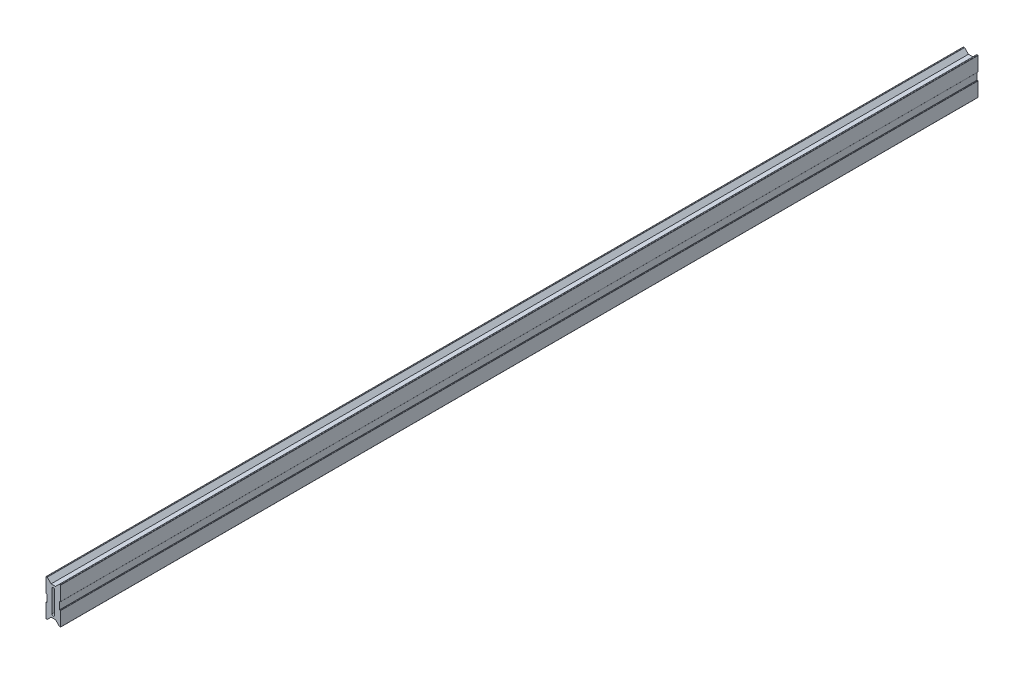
ISO-10303-21;
HEADER;
FILE_DESCRIPTION(('STEP AP214'),'2;1');
FILE_NAME('part.step','',(''),(''),'','','');
FILE_SCHEMA(('AUTOMOTIVE_DESIGN { 1 0 10303 214 1 1 1 1 }'));
ENDSEC;
DATA;
#1=APPLICATION_CONTEXT('core data for automotive mechanical design processes');
#2=APPLICATION_PROTOCOL_DEFINITION('international standard','automotive_design',2000,#1);
#3=PRODUCT_CONTEXT('',#1,'mechanical');
#4=PRODUCT('Part','Part','',(#3));
#5=PRODUCT_RELATED_PRODUCT_CATEGORY('part','',(#4));
#6=PRODUCT_DEFINITION_FORMATION('','',#4);
#7=PRODUCT_DEFINITION_CONTEXT('part definition',#1,'design');
#8=PRODUCT_DEFINITION('design','',#6,#7);
#9=PRODUCT_DEFINITION_SHAPE('','',#8);
#10=(LENGTH_UNIT() NAMED_UNIT(*) SI_UNIT(.MILLI.,.METRE.));
#11=(NAMED_UNIT(*) PLANE_ANGLE_UNIT() SI_UNIT($,.RADIAN.));
#12=(NAMED_UNIT(*) SI_UNIT($,.STERADIAN.) SOLID_ANGLE_UNIT());
#13=UNCERTAINTY_MEASURE_WITH_UNIT(LENGTH_MEASURE(1.E-05),#10,'distance_accuracy_value','');
#14=(GEOMETRIC_REPRESENTATION_CONTEXT(3) GLOBAL_UNCERTAINTY_ASSIGNED_CONTEXT((#13)) GLOBAL_UNIT_ASSIGNED_CONTEXT((#10,
#11,#12)) REPRESENTATION_CONTEXT('',''));
#15=CARTESIAN_POINT('',(0.,0.,0.));
#16=DIRECTION('',(0.,0.,1.));
#17=DIRECTION('',(1.,0.,0.));
#18=AXIS2_PLACEMENT_3D('',#15,#16,#17);
#19=CARTESIAN_POINT('',(-40.9493186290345,10.1531529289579,-238.78253442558));
#20=DIRECTION('',(0.,0.,1.));
#21=DIRECTION('',(1.,0.,0.));
#22=AXIS2_PLACEMENT_3D('',#19,#20,#21);
#23=CYLINDRICAL_SURFACE('',#22,0.127);
#24=CARTESIAN_POINT('',(-40.9493186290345,10.1531529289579,261.21646557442));
#25=DIRECTION('',(0.,0.,1.));
#26=DIRECTION('',(-1.,0.,0.));
#27=AXIS2_PLACEMENT_3D('',#24,#25,#26);
#28=CIRCLE('',#27,0.127);
#29=CARTESIAN_POINT('',(-40.9493186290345,10.2801529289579,261.21646557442));
#30=VERTEX_POINT('',#29);
#31=CARTESIAN_POINT('',(-41.0763186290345,10.1531529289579,261.21646557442));
#32=VERTEX_POINT('',#31);
#33=EDGE_CURVE('E281',#30,#32,#28,.T.);
#34=ORIENTED_EDGE('',*,*,#33,.F.);
#35=DIRECTION('',(0.,0.,1.));
#36=VECTOR('',#35,1.);
#37=CARTESIAN_POINT('',(-40.9493186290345,10.2801529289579,-238.78253442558));
#38=LINE('',#37,#36);
#39=CARTESIAN_POINT('',(-40.9493186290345,10.2801529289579,-238.78253442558));
#40=VERTEX_POINT('',#39);
#41=EDGE_CURVE('E10',#40,#30,#38,.T.);
#42=ORIENTED_EDGE('',*,*,#41,.F.);
#43=CARTESIAN_POINT('',(-40.9493186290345,10.1531529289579,-238.78253442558));
#44=DIRECTION('',(0.,0.,1.));
#45=DIRECTION('',(-1.,0.,0.));
#46=AXIS2_PLACEMENT_3D('',#43,#44,#45);
#47=CIRCLE('',#46,0.127);
#48=CARTESIAN_POINT('',(-41.0763186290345,10.1531529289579,-238.78253442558));
#49=VERTEX_POINT('',#48);
#50=EDGE_CURVE('E285',#40,#49,#47,.T.);
#51=ORIENTED_EDGE('',*,*,#50,.T.);
#52=DIRECTION('',(0.,0.,1.));
#53=VECTOR('',#52,1.);
#54=CARTESIAN_POINT('',(-41.0763186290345,10.1531529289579,-238.78253442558));
#55=LINE('',#54,#53);
#56=EDGE_CURVE('E18',#49,#32,#55,.T.);
#57=ORIENTED_EDGE('',*,*,#56,.T.);
#58=EDGE_LOOP('',(#34,#42,#51,#57));
#59=FACE_BOUND('',#58,.T.);
#60=ADVANCED_FACE('F15',(#59),#23,.T.);
#61=CARTESIAN_POINT('',(-40.5683186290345,10.2801529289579,-238.78253442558));
#62=DIRECTION('',(0.,1.,0.));
#63=DIRECTION('',(0.,0.,1.));
#64=AXIS2_PLACEMENT_3D('',#61,#62,#63);
#65=PLANE('',#64);
#66=DIRECTION('',(-1.,0.,0.));
#67=VECTOR('',#66,1.);
#68=CARTESIAN_POINT('',(-40.5683186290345,10.2801529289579,261.21646557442));
#69=LINE('',#68,#67);
#70=CARTESIAN_POINT('',(-40.5683186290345,10.2801529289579,261.21646557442));
#71=VERTEX_POINT('',#70);
#72=EDGE_CURVE('E289',#71,#30,#69,.T.);
#73=ORIENTED_EDGE('',*,*,#72,.F.);
#74=DIRECTION('',(0.,0.,1.));
#75=VECTOR('',#74,1.);
#76=CARTESIAN_POINT('',(-40.5683186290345,10.2801529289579,-238.78253442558));
#77=LINE('',#76,#75);
#78=CARTESIAN_POINT('',(-40.5683186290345,10.2801529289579,-238.78253442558));
#79=VERTEX_POINT('',#78);
#80=EDGE_CURVE('E23',#79,#71,#77,.T.);
#81=ORIENTED_EDGE('',*,*,#80,.F.);
#82=DIRECTION('',(-1.,0.,0.));
#83=VECTOR('',#82,1.);
#84=CARTESIAN_POINT('',(-40.5683186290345,10.2801529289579,-238.78253442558));
#85=LINE('',#84,#83);
#86=EDGE_CURVE('E379',#79,#40,#85,.T.);
#87=ORIENTED_EDGE('',*,*,#86,.T.);
#88=ORIENTED_EDGE('',*,*,#41,.T.);
#89=EDGE_LOOP('',(#73,#81,#87,#88));
#90=FACE_BOUND('',#89,.T.);
#91=ADVANCED_FACE('F546',(#90),#65,.T.);
#92=CARTESIAN_POINT('',(-40.5683186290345,10.2801529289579,-238.78253442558));
#93=DIRECTION('',(-1.,0.,0.));
#94=DIRECTION('',(0.,0.,1.));
#95=AXIS2_PLACEMENT_3D('',#92,#93,#94);
#96=PLANE('',#95);
#97=DIRECTION('',(0.,-1.,0.));
#98=VECTOR('',#97,1.);
#99=CARTESIAN_POINT('',(-40.5683186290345,10.2801529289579,261.21646557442));
#100=LINE('',#99,#98);
#101=CARTESIAN_POINT('',(-40.5683186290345,14.2933529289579,261.21646557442));
#102=VERTEX_POINT('',#101);
#103=EDGE_CURVE('E471',#102,#71,#100,.T.);
#104=ORIENTED_EDGE('',*,*,#103,.F.);
#105=DIRECTION('',(0.,0.,1.));
#106=VECTOR('',#105,1.);
#107=CARTESIAN_POINT('',(-40.5683186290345,14.2933529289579,-238.78253442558));
#108=LINE('',#107,#106);
#109=CARTESIAN_POINT('',(-40.5683186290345,14.2933529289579,-238.78253442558));
#110=VERTEX_POINT('',#109);
#111=EDGE_CURVE('E477',#110,#102,#108,.T.);
#112=ORIENTED_EDGE('',*,*,#111,.F.);
#113=DIRECTION('',(0.,-1.,0.));
#114=VECTOR('',#113,1.);
#115=CARTESIAN_POINT('',(-40.5683186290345,10.2801529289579,-238.78253442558));
#116=LINE('',#115,#114);
#117=EDGE_CURVE('E376',#110,#79,#116,.T.);
#118=ORIENTED_EDGE('',*,*,#117,.T.);
#119=ORIENTED_EDGE('',*,*,#80,.T.);
#120=EDGE_LOOP('',(#104,#112,#118,#119));
#121=FACE_BOUND('',#120,.T.);
#122=ADVANCED_FACE('F661',(#121),#96,.T.);
#123=CARTESIAN_POINT('',(-40.5683186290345,14.2933529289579,-238.78253442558));
#124=DIRECTION('',(0.,-1.,0.));
#125=DIRECTION('',(0.,0.,-1.));
#126=AXIS2_PLACEMENT_3D('',#123,#124,#125);
#127=PLANE('',#126);
#128=DIRECTION('',(1.,0.,0.));
#129=VECTOR('',#128,1.);
#130=CARTESIAN_POINT('',(-40.5683186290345,14.2933529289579,261.21646557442));
#131=LINE('',#130,#129);
#132=CARTESIAN_POINT('',(-40.9493186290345,14.2933529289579,261.21646557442));
#133=VERTEX_POINT('',#132);
#134=EDGE_CURVE('E468',#133,#102,#131,.T.);
#135=ORIENTED_EDGE('',*,*,#134,.F.);
#136=DIRECTION('',(0.,0.,1.));
#137=VECTOR('',#136,1.);
#138=CARTESIAN_POINT('',(-40.9493186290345,14.2933529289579,-238.78253442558));
#139=LINE('',#138,#137);
#140=CARTESIAN_POINT('',(-40.9493186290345,14.2933529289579,-238.78253442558));
#141=VERTEX_POINT('',#140);
#142=EDGE_CURVE('E479',#141,#133,#139,.T.);
#143=ORIENTED_EDGE('',*,*,#142,.F.);
#144=DIRECTION('',(1.,0.,0.));
#145=VECTOR('',#144,1.);
#146=CARTESIAN_POINT('',(-40.5683186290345,14.2933529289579,-238.78253442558));
#147=LINE('',#146,#145);
#148=EDGE_CURVE('E373',#141,#110,#147,.T.);
#149=ORIENTED_EDGE('',*,*,#148,.T.);
#150=ORIENTED_EDGE('',*,*,#111,.T.);
#151=EDGE_LOOP('',(#135,#143,#149,#150));
#152=FACE_BOUND('',#151,.T.);
#153=ADVANCED_FACE('F659',(#152),#127,.T.);
#154=CARTESIAN_POINT('',(-40.9493186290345,14.4203529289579,-238.78253442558));
#155=DIRECTION('',(0.,0.,1.));
#156=DIRECTION('',(1.,0.,0.));
#157=AXIS2_PLACEMENT_3D('',#154,#155,#156);
#158=CYLINDRICAL_SURFACE('',#157,0.127);
#159=CARTESIAN_POINT('',(-40.9493186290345,14.4203529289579,261.21646557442));
#160=DIRECTION('',(0.,0.,1.));
#161=DIRECTION('',(1.,0.,0.));
#162=AXIS2_PLACEMENT_3D('',#159,#160,#161);
#163=CIRCLE('',#162,0.127);
#164=CARTESIAN_POINT('',(-41.0763186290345,14.4203529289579,261.21646557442));
#165=VERTEX_POINT('',#164);
#166=EDGE_CURVE('E465',#165,#133,#163,.T.);
#167=ORIENTED_EDGE('',*,*,#166,.F.);
#168=DIRECTION('',(0.,0.,1.));
#169=VECTOR('',#168,1.);
#170=CARTESIAN_POINT('',(-41.0763186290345,14.4203529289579,-238.78253442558));
#171=LINE('',#170,#169);
#172=CARTESIAN_POINT('',(-41.0763186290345,14.4203529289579,-238.78253442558));
#173=VERTEX_POINT('',#172);
#174=EDGE_CURVE('E481',#173,#165,#171,.T.);
#175=ORIENTED_EDGE('',*,*,#174,.F.);
#176=CARTESIAN_POINT('',(-40.9493186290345,14.4203529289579,-238.78253442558));
#177=DIRECTION('',(0.,0.,1.));
#178=DIRECTION('',(1.,0.,0.));
#179=AXIS2_PLACEMENT_3D('',#176,#177,#178);
#180=CIRCLE('',#179,0.127);
#181=EDGE_CURVE('E370',#173,#141,#180,.T.);
#182=ORIENTED_EDGE('',*,*,#181,.T.);
#183=ORIENTED_EDGE('',*,*,#142,.T.);
#184=EDGE_LOOP('',(#167,#175,#182,#183));
#185=FACE_BOUND('',#184,.T.);
#186=ADVANCED_FACE('F655',(#185),#158,.T.);
#187=CARTESIAN_POINT('',(-41.0763186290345,22.1546529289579,-238.78253442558));
#188=DIRECTION('',(-1.,0.,0.));
#189=DIRECTION('',(0.,0.,1.));
#190=AXIS2_PLACEMENT_3D('',#187,#188,#189);
#191=PLANE('',#190);
#192=DIRECTION('',(0.,-1.,0.));
#193=VECTOR('',#192,1.);
#194=CARTESIAN_POINT('',(-41.0763186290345,22.1546529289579,261.21646557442));
#195=LINE('',#194,#193);
#196=CARTESIAN_POINT('',(-41.0763186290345,22.1546529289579,261.21646557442));
#197=VERTEX_POINT('',#196);
#198=EDGE_CURVE('E462',#197,#165,#195,.T.);
#199=ORIENTED_EDGE('',*,*,#198,.F.);
#200=DIRECTION('',(0.,0.,1.));
#201=VECTOR('',#200,1.);
#202=CARTESIAN_POINT('',(-41.0763186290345,22.1546529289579,-238.78253442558));
#203=LINE('',#202,#201);
#204=CARTESIAN_POINT('',(-41.0763186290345,22.1546529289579,-238.78253442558));
#205=VERTEX_POINT('',#204);
#206=EDGE_CURVE('E483',#205,#197,#203,.T.);
#207=ORIENTED_EDGE('',*,*,#206,.F.);
#208=DIRECTION('',(0.,-1.,0.));
#209=VECTOR('',#208,1.);
#210=CARTESIAN_POINT('',(-41.0763186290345,22.1546529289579,-238.78253442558));
#211=LINE('',#210,#209);
#212=EDGE_CURVE('E367',#205,#173,#211,.T.);
#213=ORIENTED_EDGE('',*,*,#212,.T.);
#214=ORIENTED_EDGE('',*,*,#174,.T.);
#215=EDGE_LOOP('',(#199,#207,#213,#214));
#216=FACE_BOUND('',#215,.T.);
#217=ADVANCED_FACE('F651',(#216),#191,.T.);
#218=CARTESIAN_POINT('',(-40.9493186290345,22.1546529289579,-238.78253442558));
#219=DIRECTION('',(0.,0.,1.));
#220=DIRECTION('',(1.,0.,0.));
#221=AXIS2_PLACEMENT_3D('',#218,#219,#220);
#222=CYLINDRICAL_SURFACE('',#221,0.127000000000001);
#223=CARTESIAN_POINT('',(-40.9493186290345,22.1546529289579,261.21646557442));
#224=DIRECTION('',(0.,0.,1.));
#225=DIRECTION('',(1.,0.,0.));
#226=AXIS2_PLACEMENT_3D('',#223,#224,#225);
#227=CIRCLE('',#226,0.127000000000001);
#228=CARTESIAN_POINT('',(-40.9493186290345,22.2816529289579,261.21646557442));
#229=VERTEX_POINT('',#228);
#230=EDGE_CURVE('E459',#229,#197,#227,.T.);
#231=ORIENTED_EDGE('',*,*,#230,.F.);
#232=DIRECTION('',(0.,0.,1.));
#233=VECTOR('',#232,1.);
#234=CARTESIAN_POINT('',(-40.9493186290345,22.2816529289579,-238.78253442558));
#235=LINE('',#234,#233);
#236=CARTESIAN_POINT('',(-40.9493186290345,22.2816529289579,-238.78253442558));
#237=VERTEX_POINT('',#236);
#238=EDGE_CURVE('E485',#237,#229,#235,.T.);
#239=ORIENTED_EDGE('',*,*,#238,.F.);
#240=CARTESIAN_POINT('',(-40.9493186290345,22.1546529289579,-238.78253442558));
#241=DIRECTION('',(0.,0.,1.));
#242=DIRECTION('',(1.,0.,0.));
#243=AXIS2_PLACEMENT_3D('',#240,#241,#242);
#244=CIRCLE('',#243,0.127000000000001);
#245=EDGE_CURVE('E364',#237,#205,#244,.T.);
#246=ORIENTED_EDGE('',*,*,#245,.T.);
#247=ORIENTED_EDGE('',*,*,#206,.T.);
#248=EDGE_LOOP('',(#231,#239,#246,#247));
#249=FACE_BOUND('',#248,.T.);
#250=ADVANCED_FACE('F647',(#249),#222,.T.);
#251=CARTESIAN_POINT('',(-40.9493186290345,22.2816529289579,-238.78253442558));
#252=DIRECTION('',(0.,1.,0.));
#253=DIRECTION('',(0.,0.,1.));
#254=AXIS2_PLACEMENT_3D('',#251,#252,#253);
#255=PLANE('',#254);
#256=DIRECTION('',(-1.,0.,0.));
#257=VECTOR('',#256,1.);
#258=CARTESIAN_POINT('',(-40.9493186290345,22.2816529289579,261.21646557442));
#259=LINE('',#258,#257);
#260=CARTESIAN_POINT('',(-40.4685237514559,22.2816529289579,261.21646557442));
#261=VERTEX_POINT('',#260);
#262=EDGE_CURVE('E456',#261,#229,#259,.T.);
#263=ORIENTED_EDGE('',*,*,#262,.F.);
#264=DIRECTION('',(0.,0.,1.));
#265=VECTOR('',#264,1.);
#266=CARTESIAN_POINT('',(-40.4685237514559,22.2816529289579,-238.78253442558));
#267=LINE('',#266,#265);
#268=CARTESIAN_POINT('',(-40.4685237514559,22.2816529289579,-238.78253442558));
#269=VERTEX_POINT('',#268);
#270=EDGE_CURVE('E487',#269,#261,#267,.T.);
#271=ORIENTED_EDGE('',*,*,#270,.F.);
#272=DIRECTION('',(-1.,0.,0.));
#273=VECTOR('',#272,1.);
#274=CARTESIAN_POINT('',(-40.9493186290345,22.2816529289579,-238.78253442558));
#275=LINE('',#274,#273);
#276=EDGE_CURVE('E361',#269,#237,#275,.T.);
#277=ORIENTED_EDGE('',*,*,#276,.T.);
#278=ORIENTED_EDGE('',*,*,#238,.T.);
#279=EDGE_LOOP('',(#263,#271,#277,#278));
#280=FACE_BOUND('',#279,.T.);
#281=ADVANCED_FACE('F643',(#280),#255,.T.);
#282=CARTESIAN_POINT('',(-40.4685237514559,22.1546529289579,-238.78253442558));
#283=DIRECTION('',(0.,0.,1.));
#284=DIRECTION('',(1.,0.,0.));
#285=AXIS2_PLACEMENT_3D('',#282,#283,#284);
#286=CYLINDRICAL_SURFACE('',#285,0.127000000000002);
#287=CARTESIAN_POINT('',(-40.4685237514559,22.1546529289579,261.21646557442));
#288=DIRECTION('',(0.,0.,1.));
#289=DIRECTION('',(1.,0.,0.));
#290=AXIS2_PLACEMENT_3D('',#287,#288,#289);
#291=CIRCLE('',#290,0.127000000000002);
#292=CARTESIAN_POINT('',(-40.3787211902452,22.2444554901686,261.21646557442));
#293=VERTEX_POINT('',#292);
#294=EDGE_CURVE('E453',#293,#261,#291,.T.);
#295=ORIENTED_EDGE('',*,*,#294,.F.);
#296=DIRECTION('',(0.,0.,1.));
#297=VECTOR('',#296,1.);
#298=CARTESIAN_POINT('',(-40.3787211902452,22.2444554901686,-238.78253442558));
#299=LINE('',#298,#297);
#300=CARTESIAN_POINT('',(-40.3787211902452,22.2444554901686,-238.78253442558));
#301=VERTEX_POINT('',#300);
#302=EDGE_CURVE('E489',#301,#293,#299,.T.);
#303=ORIENTED_EDGE('',*,*,#302,.F.);
#304=CARTESIAN_POINT('',(-40.4685237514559,22.1546529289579,-238.78253442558));
#305=DIRECTION('',(0.,0.,1.));
#306=DIRECTION('',(1.,0.,0.));
#307=AXIS2_PLACEMENT_3D('',#304,#305,#306);
#308=CIRCLE('',#307,0.127000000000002);
#309=EDGE_CURVE('E358',#301,#269,#308,.T.);
#310=ORIENTED_EDGE('',*,*,#309,.T.);
#311=ORIENTED_EDGE('',*,*,#270,.T.);
#312=EDGE_LOOP('',(#295,#303,#310,#311));
#313=FACE_BOUND('',#312,.T.);
#314=ADVANCED_FACE('F639',(#313),#286,.T.);
#315=CARTESIAN_POINT('',(-38.2823186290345,20.1480529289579,-238.78253442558));
#316=DIRECTION('',(0.707106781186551,0.707106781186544,0.));
#317=DIRECTION('',(-0.707106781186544,0.707106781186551,0.));
#318=AXIS2_PLACEMENT_3D('',#315,#316,#317);
#319=PLANE('',#318);
#320=DIRECTION('',(-0.707106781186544,0.707106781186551,0.));
#321=VECTOR('',#320,1.);
#322=CARTESIAN_POINT('',(-38.2823186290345,20.1480529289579,261.21646557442));
#323=LINE('',#322,#321);
#324=CARTESIAN_POINT('',(-38.2823186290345,20.1480529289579,261.21646557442));
#325=VERTEX_POINT('',#324);
#326=EDGE_CURVE('E450',#325,#293,#323,.T.);
#327=ORIENTED_EDGE('',*,*,#326,.F.);
#328=DIRECTION('',(0.,0.,1.));
#329=VECTOR('',#328,1.);
#330=CARTESIAN_POINT('',(-38.2823186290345,20.1480529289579,-238.78253442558));
#331=LINE('',#330,#329);
#332=CARTESIAN_POINT('',(-38.2823186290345,20.1480529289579,-238.78253442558));
#333=VERTEX_POINT('',#332);
#334=EDGE_CURVE('E491',#333,#325,#331,.T.);
#335=ORIENTED_EDGE('',*,*,#334,.F.);
#336=DIRECTION('',(-0.707106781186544,0.707106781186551,0.));
#337=VECTOR('',#336,1.);
#338=CARTESIAN_POINT('',(-38.2823186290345,20.1480529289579,-238.78253442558));
#339=LINE('',#338,#337);
#340=EDGE_CURVE('E355',#333,#301,#339,.T.);
#341=ORIENTED_EDGE('',*,*,#340,.T.);
#342=ORIENTED_EDGE('',*,*,#302,.T.);
#343=EDGE_LOOP('',(#327,#335,#341,#342));
#344=FACE_BOUND('',#343,.T.);
#345=ADVANCED_FACE('F635',(#344),#319,.T.);
#346=CARTESIAN_POINT('',(-38.2823186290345,20.1480529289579,-238.78253442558));
#347=DIRECTION('',(0.,1.,0.));
#348=DIRECTION('',(0.,0.,1.));
#349=AXIS2_PLACEMENT_3D('',#346,#347,#348);
#350=PLANE('',#349);
#351=DIRECTION('',(-1.,0.,0.));
#352=VECTOR('',#351,1.);
#353=CARTESIAN_POINT('',(-38.2823186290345,20.1480529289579,261.21646557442));
#354=LINE('',#353,#352);
#355=CARTESIAN_POINT('',(-35.8693186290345,20.1480529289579,261.21646557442));
#356=VERTEX_POINT('',#355);
#357=EDGE_CURVE('E447',#356,#325,#354,.T.);
#358=ORIENTED_EDGE('',*,*,#357,.F.);
#359=DIRECTION('',(0.,0.,1.));
#360=VECTOR('',#359,1.);
#361=CARTESIAN_POINT('',(-35.8693186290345,20.1480529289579,-238.78253442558));
#362=LINE('',#361,#360);
#363=CARTESIAN_POINT('',(-35.8693186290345,20.1480529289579,-238.78253442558));
#364=VERTEX_POINT('',#363);
#365=EDGE_CURVE('E493',#364,#356,#362,.T.);
#366=ORIENTED_EDGE('',*,*,#365,.F.);
#367=DIRECTION('',(-1.,0.,0.));
#368=VECTOR('',#367,1.);
#369=CARTESIAN_POINT('',(-38.2823186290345,20.1480529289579,-238.78253442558));
#370=LINE('',#369,#368);
#371=EDGE_CURVE('E352',#364,#333,#370,.T.);
#372=ORIENTED_EDGE('',*,*,#371,.T.);
#373=ORIENTED_EDGE('',*,*,#334,.T.);
#374=EDGE_LOOP('',(#358,#366,#372,#373));
#375=FACE_BOUND('',#374,.T.);
#376=ADVANCED_FACE('F631',(#375),#350,.T.);
#377=CARTESIAN_POINT('',(-35.8693186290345,20.1480529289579,-238.78253442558));
#378=DIRECTION('',(-0.707106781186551,0.707106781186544,0.));
#379=DIRECTION('',(-0.707106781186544,-0.707106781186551,0.));
#380=AXIS2_PLACEMENT_3D('',#377,#378,#379);
#381=PLANE('',#380);
#382=DIRECTION('',(-0.707106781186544,-0.707106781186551,0.));
#383=VECTOR('',#382,1.);
#384=CARTESIAN_POINT('',(-35.8693186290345,20.1480529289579,261.21646557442));
#385=LINE('',#384,#383);
#386=CARTESIAN_POINT('',(-33.7729160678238,22.2444554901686,261.21646557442));
#387=VERTEX_POINT('',#386);
#388=EDGE_CURVE('E444',#387,#356,#385,.T.);
#389=ORIENTED_EDGE('',*,*,#388,.F.);
#390=DIRECTION('',(0.,0.,1.));
#391=VECTOR('',#390,1.);
#392=CARTESIAN_POINT('',(-33.7729160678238,22.2444554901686,-238.78253442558));
#393=LINE('',#392,#391);
#394=CARTESIAN_POINT('',(-33.7729160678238,22.2444554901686,-238.78253442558));
#395=VERTEX_POINT('',#394);
#396=EDGE_CURVE('E495',#395,#387,#393,.T.);
#397=ORIENTED_EDGE('',*,*,#396,.F.);
#398=DIRECTION('',(-0.707106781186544,-0.707106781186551,0.));
#399=VECTOR('',#398,1.);
#400=CARTESIAN_POINT('',(-35.8693186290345,20.1480529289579,-238.78253442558));
#401=LINE('',#400,#399);
#402=EDGE_CURVE('E349',#395,#364,#401,.T.);
#403=ORIENTED_EDGE('',*,*,#402,.T.);
#404=ORIENTED_EDGE('',*,*,#365,.T.);
#405=EDGE_LOOP('',(#389,#397,#403,#404));
#406=FACE_BOUND('',#405,.T.);
#407=ADVANCED_FACE('F627',(#406),#381,.T.);
#408=CARTESIAN_POINT('',(-33.6831135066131,22.1546529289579,-238.78253442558));
#409=DIRECTION('',(0.,0.,1.));
#410=DIRECTION('',(1.,0.,0.));
#411=AXIS2_PLACEMENT_3D('',#408,#409,#410);
#412=CYLINDRICAL_SURFACE('',#411,0.127000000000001);
#413=CARTESIAN_POINT('',(-33.6831135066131,22.1546529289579,261.21646557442));
#414=DIRECTION('',(0.,0.,1.));
#415=DIRECTION('',(-1.,0.,0.));
#416=AXIS2_PLACEMENT_3D('',#413,#414,#415);
#417=CIRCLE('',#416,0.127000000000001);
#418=CARTESIAN_POINT('',(-33.6831135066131,22.2816529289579,261.21646557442));
#419=VERTEX_POINT('',#418);
#420=EDGE_CURVE('E441',#419,#387,#417,.T.);
#421=ORIENTED_EDGE('',*,*,#420,.F.);
#422=DIRECTION('',(0.,0.,1.));
#423=VECTOR('',#422,1.);
#424=CARTESIAN_POINT('',(-33.6831135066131,22.2816529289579,-238.78253442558));
#425=LINE('',#424,#423);
#426=CARTESIAN_POINT('',(-33.6831135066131,22.2816529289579,-238.78253442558));
#427=VERTEX_POINT('',#426);
#428=EDGE_CURVE('E497',#427,#419,#425,.T.);
#429=ORIENTED_EDGE('',*,*,#428,.F.);
#430=CARTESIAN_POINT('',(-33.6831135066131,22.1546529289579,-238.78253442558));
#431=DIRECTION('',(0.,0.,1.));
#432=DIRECTION('',(-1.,0.,0.));
#433=AXIS2_PLACEMENT_3D('',#430,#431,#432);
#434=CIRCLE('',#433,0.127000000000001);
#435=EDGE_CURVE('E346',#427,#395,#434,.T.);
#436=ORIENTED_EDGE('',*,*,#435,.T.);
#437=ORIENTED_EDGE('',*,*,#396,.T.);
#438=EDGE_LOOP('',(#421,#429,#436,#437));
#439=FACE_BOUND('',#438,.T.);
#440=ADVANCED_FACE('F623',(#439),#412,.T.);
#441=CARTESIAN_POINT('',(-33.2023186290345,22.2816529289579,-238.78253442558));
#442=DIRECTION('',(0.,1.,0.));
#443=DIRECTION('',(0.,0.,1.));
#444=AXIS2_PLACEMENT_3D('',#441,#442,#443);
#445=PLANE('',#444);
#446=DIRECTION('',(-1.,0.,0.));
#447=VECTOR('',#446,1.);
#448=CARTESIAN_POINT('',(-33.2023186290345,22.2816529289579,261.21646557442));
#449=LINE('',#448,#447);
#450=CARTESIAN_POINT('',(-33.2023186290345,22.2816529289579,261.21646557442));
#451=VERTEX_POINT('',#450);
#452=EDGE_CURVE('E438',#451,#419,#449,.T.);
#453=ORIENTED_EDGE('',*,*,#452,.F.);
#454=DIRECTION('',(0.,0.,1.));
#455=VECTOR('',#454,1.);
#456=CARTESIAN_POINT('',(-33.2023186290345,22.2816529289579,-238.78253442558));
#457=LINE('',#456,#455);
#458=CARTESIAN_POINT('',(-33.2023186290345,22.2816529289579,-238.78253442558));
#459=VERTEX_POINT('',#458);
#460=EDGE_CURVE('E499',#459,#451,#457,.T.);
#461=ORIENTED_EDGE('',*,*,#460,.F.);
#462=DIRECTION('',(-1.,0.,0.));
#463=VECTOR('',#462,1.);
#464=CARTESIAN_POINT('',(-33.2023186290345,22.2816529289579,-238.78253442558));
#465=LINE('',#464,#463);
#466=EDGE_CURVE('E343',#459,#427,#465,.T.);
#467=ORIENTED_EDGE('',*,*,#466,.T.);
#468=ORIENTED_EDGE('',*,*,#428,.T.);
#469=EDGE_LOOP('',(#453,#461,#467,#468));
#470=FACE_BOUND('',#469,.T.);
#471=ADVANCED_FACE('F619',(#470),#445,.T.);
#472=CARTESIAN_POINT('',(-33.2023186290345,22.1546529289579,-238.78253442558));
#473=DIRECTION('',(0.,0.,1.));
#474=DIRECTION('',(1.,0.,0.));
#475=AXIS2_PLACEMENT_3D('',#472,#473,#474);
#476=CYLINDRICAL_SURFACE('',#475,0.127000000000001);
#477=CARTESIAN_POINT('',(-33.2023186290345,22.1546529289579,261.21646557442));
#478=DIRECTION('',(0.,0.,1.));
#479=DIRECTION('',(-1.,0.,0.));
#480=AXIS2_PLACEMENT_3D('',#477,#478,#479);
#481=CIRCLE('',#480,0.127000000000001);
#482=CARTESIAN_POINT('',(-33.0753186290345,22.1546529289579,261.21646557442));
#483=VERTEX_POINT('',#482);
#484=EDGE_CURVE('E435',#483,#451,#481,.T.);
#485=ORIENTED_EDGE('',*,*,#484,.F.);
#486=DIRECTION('',(0.,0.,1.));
#487=VECTOR('',#486,1.);
#488=CARTESIAN_POINT('',(-33.0753186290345,22.1546529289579,-238.78253442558));
#489=LINE('',#488,#487);
#490=CARTESIAN_POINT('',(-33.0753186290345,22.1546529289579,-238.78253442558));
#491=VERTEX_POINT('',#490);
#492=EDGE_CURVE('E501',#491,#483,#489,.T.);
#493=ORIENTED_EDGE('',*,*,#492,.F.);
#494=CARTESIAN_POINT('',(-33.2023186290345,22.1546529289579,-238.78253442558));
#495=DIRECTION('',(0.,0.,1.));
#496=DIRECTION('',(-1.,0.,0.));
#497=AXIS2_PLACEMENT_3D('',#494,#495,#496);
#498=CIRCLE('',#497,0.127000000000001);
#499=EDGE_CURVE('E340',#491,#459,#498,.T.);
#500=ORIENTED_EDGE('',*,*,#499,.T.);
#501=ORIENTED_EDGE('',*,*,#460,.T.);
#502=EDGE_LOOP('',(#485,#493,#500,#501));
#503=FACE_BOUND('',#502,.T.);
#504=ADVANCED_FACE('F615',(#503),#476,.T.);
#505=CARTESIAN_POINT('',(-33.0753186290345,22.1546529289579,-238.78253442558));
#506=DIRECTION('',(1.,0.,0.));
#507=DIRECTION('',(0.,0.,-1.));
#508=AXIS2_PLACEMENT_3D('',#505,#506,#507);
#509=PLANE('',#508);
#510=DIRECTION('',(0.,1.,0.));
#511=VECTOR('',#510,1.);
#512=CARTESIAN_POINT('',(-33.0753186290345,22.1546529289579,261.21646557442));
#513=LINE('',#512,#511);
#514=CARTESIAN_POINT('',(-33.0753186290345,14.4203529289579,261.21646557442));
#515=VERTEX_POINT('',#514);
#516=EDGE_CURVE('E432',#515,#483,#513,.T.);
#517=ORIENTED_EDGE('',*,*,#516,.F.);
#518=DIRECTION('',(0.,0.,1.));
#519=VECTOR('',#518,1.);
#520=CARTESIAN_POINT('',(-33.0753186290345,14.4203529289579,-238.78253442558));
#521=LINE('',#520,#519);
#522=CARTESIAN_POINT('',(-33.0753186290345,14.4203529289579,-238.78253442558));
#523=VERTEX_POINT('',#522);
#524=EDGE_CURVE('E503',#523,#515,#521,.T.);
#525=ORIENTED_EDGE('',*,*,#524,.F.);
#526=DIRECTION('',(0.,1.,0.));
#527=VECTOR('',#526,1.);
#528=CARTESIAN_POINT('',(-33.0753186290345,22.1546529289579,-238.78253442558));
#529=LINE('',#528,#527);
#530=EDGE_CURVE('E337',#523,#491,#529,.T.);
#531=ORIENTED_EDGE('',*,*,#530,.T.);
#532=ORIENTED_EDGE('',*,*,#492,.T.);
#533=EDGE_LOOP('',(#517,#525,#531,#532));
#534=FACE_BOUND('',#533,.T.);
#535=ADVANCED_FACE('F611',(#534),#509,.T.);
#536=CARTESIAN_POINT('',(-33.2023186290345,14.4203529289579,-238.78253442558));
#537=DIRECTION('',(0.,0.,1.));
#538=DIRECTION('',(1.,0.,0.));
#539=AXIS2_PLACEMENT_3D('',#536,#537,#538);
#540=CYLINDRICAL_SURFACE('',#539,0.127);
#541=CARTESIAN_POINT('',(-33.2023186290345,14.4203529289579,261.21646557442));
#542=DIRECTION('',(0.,0.,1.));
#543=DIRECTION('',(-1.,0.,0.));
#544=AXIS2_PLACEMENT_3D('',#541,#542,#543);
#545=CIRCLE('',#544,0.127);
#546=CARTESIAN_POINT('',(-33.2023186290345,14.2933529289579,261.21646557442));
#547=VERTEX_POINT('',#546);
#548=EDGE_CURVE('E429',#547,#515,#545,.T.);
#549=ORIENTED_EDGE('',*,*,#548,.F.);
#550=DIRECTION('',(0.,0.,1.));
#551=VECTOR('',#550,1.);
#552=CARTESIAN_POINT('',(-33.2023186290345,14.2933529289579,-238.78253442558));
#553=LINE('',#552,#551);
#554=CARTESIAN_POINT('',(-33.2023186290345,14.2933529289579,-238.78253442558));
#555=VERTEX_POINT('',#554);
#556=EDGE_CURVE('E505',#555,#547,#553,.T.);
#557=ORIENTED_EDGE('',*,*,#556,.F.);
#558=CARTESIAN_POINT('',(-33.2023186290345,14.4203529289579,-238.78253442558));
#559=DIRECTION('',(0.,0.,1.));
#560=DIRECTION('',(-1.,0.,0.));
#561=AXIS2_PLACEMENT_3D('',#558,#559,#560);
#562=CIRCLE('',#561,0.127);
#563=EDGE_CURVE('E334',#555,#523,#562,.T.);
#564=ORIENTED_EDGE('',*,*,#563,.T.);
#565=ORIENTED_EDGE('',*,*,#524,.T.);
#566=EDGE_LOOP('',(#549,#557,#564,#565));
#567=FACE_BOUND('',#566,.T.);
#568=ADVANCED_FACE('F607',(#567),#540,.T.);
#569=CARTESIAN_POINT('',(-33.5833186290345,14.2933529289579,-238.78253442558));
#570=DIRECTION('',(0.,-1.,0.));
#571=DIRECTION('',(0.,0.,-1.));
#572=AXIS2_PLACEMENT_3D('',#569,#570,#571);
#573=PLANE('',#572);
#574=DIRECTION('',(1.,0.,0.));
#575=VECTOR('',#574,1.);
#576=CARTESIAN_POINT('',(-33.5833186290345,14.2933529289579,261.21646557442));
#577=LINE('',#576,#575);
#578=CARTESIAN_POINT('',(-33.5833186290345,14.2933529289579,261.21646557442));
#579=VERTEX_POINT('',#578);
#580=EDGE_CURVE('E426',#579,#547,#577,.T.);
#581=ORIENTED_EDGE('',*,*,#580,.F.);
#582=DIRECTION('',(0.,0.,1.));
#583=VECTOR('',#582,1.);
#584=CARTESIAN_POINT('',(-33.5833186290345,14.2933529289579,-238.78253442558));
#585=LINE('',#584,#583);
#586=CARTESIAN_POINT('',(-33.5833186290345,14.2933529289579,-238.78253442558));
#587=VERTEX_POINT('',#586);
#588=EDGE_CURVE('E507',#587,#579,#585,.T.);
#589=ORIENTED_EDGE('',*,*,#588,.F.);
#590=DIRECTION('',(1.,0.,0.));
#591=VECTOR('',#590,1.);
#592=CARTESIAN_POINT('',(-33.5833186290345,14.2933529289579,-238.78253442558));
#593=LINE('',#592,#591);
#594=EDGE_CURVE('E331',#587,#555,#593,.T.);
#595=ORIENTED_EDGE('',*,*,#594,.T.);
#596=ORIENTED_EDGE('',*,*,#556,.T.);
#597=EDGE_LOOP('',(#581,#589,#595,#596));
#598=FACE_BOUND('',#597,.T.);
#599=ADVANCED_FACE('F603',(#598),#573,.T.);
#600=CARTESIAN_POINT('',(-33.5833186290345,10.2801529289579,-238.78253442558));
#601=DIRECTION('',(1.,0.,0.));
#602=DIRECTION('',(0.,0.,-1.));
#603=AXIS2_PLACEMENT_3D('',#600,#601,#602);
#604=PLANE('',#603);
#605=DIRECTION('',(0.,1.,0.));
#606=VECTOR('',#605,1.);
#607=CARTESIAN_POINT('',(-33.5833186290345,10.2801529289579,261.21646557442));
#608=LINE('',#607,#606);
#609=CARTESIAN_POINT('',(-33.5833186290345,10.2801529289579,261.21646557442));
#610=VERTEX_POINT('',#609);
#611=EDGE_CURVE('E423',#610,#579,#608,.T.);
#612=ORIENTED_EDGE('',*,*,#611,.F.);
#613=DIRECTION('',(0.,0.,1.));
#614=VECTOR('',#613,1.);
#615=CARTESIAN_POINT('',(-33.5833186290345,10.2801529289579,-238.78253442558));
#616=LINE('',#615,#614);
#617=CARTESIAN_POINT('',(-33.5833186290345,10.2801529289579,-238.78253442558));
#618=VERTEX_POINT('',#617);
#619=EDGE_CURVE('E509',#618,#610,#616,.T.);
#620=ORIENTED_EDGE('',*,*,#619,.F.);
#621=DIRECTION('',(0.,1.,0.));
#622=VECTOR('',#621,1.);
#623=CARTESIAN_POINT('',(-33.5833186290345,10.2801529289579,-238.78253442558));
#624=LINE('',#623,#622);
#625=EDGE_CURVE('E328',#618,#587,#624,.T.);
#626=ORIENTED_EDGE('',*,*,#625,.T.);
#627=ORIENTED_EDGE('',*,*,#588,.T.);
#628=EDGE_LOOP('',(#612,#620,#626,#627));
#629=FACE_BOUND('',#628,.T.);
#630=ADVANCED_FACE('F599',(#629),#604,.T.);
#631=CARTESIAN_POINT('',(-33.5833186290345,10.2801529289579,-238.78253442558));
#632=DIRECTION('',(0.,1.,0.));
#633=DIRECTION('',(0.,0.,1.));
#634=AXIS2_PLACEMENT_3D('',#631,#632,#633);
#635=PLANE('',#634);
#636=DIRECTION('',(-1.,0.,0.));
#637=VECTOR('',#636,1.);
#638=CARTESIAN_POINT('',(-33.5833186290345,10.2801529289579,261.21646557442));
#639=LINE('',#638,#637);
#640=CARTESIAN_POINT('',(-33.2023186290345,10.2801529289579,261.21646557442));
#641=VERTEX_POINT('',#640);
#642=EDGE_CURVE('E420',#641,#610,#639,.T.);
#643=ORIENTED_EDGE('',*,*,#642,.F.);
#644=DIRECTION('',(0.,0.,1.));
#645=VECTOR('',#644,1.);
#646=CARTESIAN_POINT('',(-33.2023186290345,10.2801529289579,-238.78253442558));
#647=LINE('',#646,#645);
#648=CARTESIAN_POINT('',(-33.2023186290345,10.2801529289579,-238.78253442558));
#649=VERTEX_POINT('',#648);
#650=EDGE_CURVE('E511',#649,#641,#647,.T.);
#651=ORIENTED_EDGE('',*,*,#650,.F.);
#652=DIRECTION('',(-1.,0.,0.));
#653=VECTOR('',#652,1.);
#654=CARTESIAN_POINT('',(-33.5833186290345,10.2801529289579,-238.78253442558));
#655=LINE('',#654,#653);
#656=EDGE_CURVE('E325',#649,#618,#655,.T.);
#657=ORIENTED_EDGE('',*,*,#656,.T.);
#658=ORIENTED_EDGE('',*,*,#619,.T.);
#659=EDGE_LOOP('',(#643,#651,#657,#658));
#660=FACE_BOUND('',#659,.T.);
#661=ADVANCED_FACE('F595',(#660),#635,.T.);
#662=CARTESIAN_POINT('',(-33.2023186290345,10.1531529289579,-238.78253442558));
#663=DIRECTION('',(0.,0.,1.));
#664=DIRECTION('',(1.,0.,0.));
#665=AXIS2_PLACEMENT_3D('',#662,#663,#664);
#666=CYLINDRICAL_SURFACE('',#665,0.127);
#667=CARTESIAN_POINT('',(-33.2023186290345,10.1531529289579,261.21646557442));
#668=DIRECTION('',(0.,0.,1.));
#669=DIRECTION('',(1.,0.,0.));
#670=AXIS2_PLACEMENT_3D('',#667,#668,#669);
#671=CIRCLE('',#670,0.127);
#672=CARTESIAN_POINT('',(-33.0753186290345,10.1531529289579,261.21646557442));
#673=VERTEX_POINT('',#672);
#674=EDGE_CURVE('E417',#673,#641,#671,.T.);
#675=ORIENTED_EDGE('',*,*,#674,.F.);
#676=DIRECTION('',(0.,0.,1.));
#677=VECTOR('',#676,1.);
#678=CARTESIAN_POINT('',(-33.0753186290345,10.1531529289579,-238.78253442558));
#679=LINE('',#678,#677);
#680=CARTESIAN_POINT('',(-33.0753186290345,10.1531529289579,-238.78253442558));
#681=VERTEX_POINT('',#680);
#682=EDGE_CURVE('E513',#681,#673,#679,.T.);
#683=ORIENTED_EDGE('',*,*,#682,.F.);
#684=CARTESIAN_POINT('',(-33.2023186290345,10.1531529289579,-238.78253442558));
#685=DIRECTION('',(0.,0.,1.));
#686=DIRECTION('',(1.,0.,0.));
#687=AXIS2_PLACEMENT_3D('',#684,#685,#686);
#688=CIRCLE('',#687,0.127);
#689=EDGE_CURVE('E322',#681,#649,#688,.T.);
#690=ORIENTED_EDGE('',*,*,#689,.T.);
#691=ORIENTED_EDGE('',*,*,#650,.T.);
#692=EDGE_LOOP('',(#675,#683,#690,#691));
#693=FACE_BOUND('',#692,.T.);
#694=ADVANCED_FACE('F591',(#693),#666,.T.);
#695=CARTESIAN_POINT('',(-33.0753186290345,2.41885292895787,-238.78253442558));
#696=DIRECTION('',(1.,0.,0.));
#697=DIRECTION('',(0.,0.,-1.));
#698=AXIS2_PLACEMENT_3D('',#695,#696,#697);
#699=PLANE('',#698);
#700=DIRECTION('',(0.,1.,0.));
#701=VECTOR('',#700,1.);
#702=CARTESIAN_POINT('',(-33.0753186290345,2.41885292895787,261.21646557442));
#703=LINE('',#702,#701);
#704=CARTESIAN_POINT('',(-33.0753186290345,2.41885292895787,261.21646557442));
#705=VERTEX_POINT('',#704);
#706=EDGE_CURVE('E414',#705,#673,#703,.T.);
#707=ORIENTED_EDGE('',*,*,#706,.F.);
#708=DIRECTION('',(0.,0.,1.));
#709=VECTOR('',#708,1.);
#710=CARTESIAN_POINT('',(-33.0753186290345,2.41885292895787,-238.78253442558));
#711=LINE('',#710,#709);
#712=CARTESIAN_POINT('',(-33.0753186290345,2.41885292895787,-238.78253442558));
#713=VERTEX_POINT('',#712);
#714=EDGE_CURVE('E515',#713,#705,#711,.T.);
#715=ORIENTED_EDGE('',*,*,#714,.F.);
#716=DIRECTION('',(0.,1.,0.));
#717=VECTOR('',#716,1.);
#718=CARTESIAN_POINT('',(-33.0753186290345,2.41885292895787,-238.78253442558));
#719=LINE('',#718,#717);
#720=EDGE_CURVE('E319',#713,#681,#719,.T.);
#721=ORIENTED_EDGE('',*,*,#720,.T.);
#722=ORIENTED_EDGE('',*,*,#682,.T.);
#723=EDGE_LOOP('',(#707,#715,#721,#722));
#724=FACE_BOUND('',#723,.T.);
#725=ADVANCED_FACE('F587',(#724),#699,.T.);
#726=CARTESIAN_POINT('',(-33.2023186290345,2.41885292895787,-238.78253442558));
#727=DIRECTION('',(0.,0.,1.));
#728=DIRECTION('',(1.,0.,0.));
#729=AXIS2_PLACEMENT_3D('',#726,#727,#728);
#730=CYLINDRICAL_SURFACE('',#729,0.127);
#731=CARTESIAN_POINT('',(-33.2023186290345,2.41885292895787,261.21646557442));
#732=DIRECTION('',(0.,0.,1.));
#733=DIRECTION('',(1.,0.,0.));
#734=AXIS2_PLACEMENT_3D('',#731,#732,#733);
#735=CIRCLE('',#734,0.127);
#736=CARTESIAN_POINT('',(-33.2023186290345,2.29185292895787,261.21646557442));
#737=VERTEX_POINT('',#736);
#738=EDGE_CURVE('E411',#737,#705,#735,.T.);
#739=ORIENTED_EDGE('',*,*,#738,.F.);
#740=DIRECTION('',(0.,0.,1.));
#741=VECTOR('',#740,1.);
#742=CARTESIAN_POINT('',(-33.2023186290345,2.29185292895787,-238.78253442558));
#743=LINE('',#742,#741);
#744=CARTESIAN_POINT('',(-33.2023186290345,2.29185292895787,-238.78253442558));
#745=VERTEX_POINT('',#744);
#746=EDGE_CURVE('E517',#745,#737,#743,.T.);
#747=ORIENTED_EDGE('',*,*,#746,.F.);
#748=CARTESIAN_POINT('',(-33.2023186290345,2.41885292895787,-238.78253442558));
#749=DIRECTION('',(0.,0.,1.));
#750=DIRECTION('',(1.,0.,0.));
#751=AXIS2_PLACEMENT_3D('',#748,#749,#750);
#752=CIRCLE('',#751,0.127);
#753=EDGE_CURVE('E316',#745,#713,#752,.T.);
#754=ORIENTED_EDGE('',*,*,#753,.T.);
#755=ORIENTED_EDGE('',*,*,#714,.T.);
#756=EDGE_LOOP('',(#739,#747,#754,#755));
#757=FACE_BOUND('',#756,.T.);
#758=ADVANCED_FACE('F583',(#757),#730,.T.);
#759=CARTESIAN_POINT('',(-33.2023186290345,2.29185292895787,-238.78253442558));
#760=DIRECTION('',(0.,-1.,0.));
#761=DIRECTION('',(0.,0.,-1.));
#762=AXIS2_PLACEMENT_3D('',#759,#760,#761);
#763=PLANE('',#762);
#764=DIRECTION('',(1.,0.,0.));
#765=VECTOR('',#764,1.);
#766=CARTESIAN_POINT('',(-33.2023186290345,2.29185292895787,261.21646557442));
#767=LINE('',#766,#765);
#768=CARTESIAN_POINT('',(-33.6831135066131,2.29185292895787,261.21646557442));
#769=VERTEX_POINT('',#768);
#770=EDGE_CURVE('E408',#769,#737,#767,.T.);
#771=ORIENTED_EDGE('',*,*,#770,.F.);
#772=DIRECTION('',(0.,0.,1.));
#773=VECTOR('',#772,1.);
#774=CARTESIAN_POINT('',(-33.6831135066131,2.29185292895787,-238.78253442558));
#775=LINE('',#774,#773);
#776=CARTESIAN_POINT('',(-33.6831135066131,2.29185292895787,-238.78253442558));
#777=VERTEX_POINT('',#776);
#778=EDGE_CURVE('E519',#777,#769,#775,.T.);
#779=ORIENTED_EDGE('',*,*,#778,.F.);
#780=DIRECTION('',(1.,0.,0.));
#781=VECTOR('',#780,1.);
#782=CARTESIAN_POINT('',(-33.2023186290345,2.29185292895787,-238.78253442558));
#783=LINE('',#782,#781);
#784=EDGE_CURVE('E313',#777,#745,#783,.T.);
#785=ORIENTED_EDGE('',*,*,#784,.T.);
#786=ORIENTED_EDGE('',*,*,#746,.T.);
#787=EDGE_LOOP('',(#771,#779,#785,#786));
#788=FACE_BOUND('',#787,.T.);
#789=ADVANCED_FACE('F579',(#788),#763,.T.);
#790=CARTESIAN_POINT('',(-33.6831135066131,2.41885292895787,-238.78253442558));
#791=DIRECTION('',(0.,0.,1.));
#792=DIRECTION('',(1.,0.,0.));
#793=AXIS2_PLACEMENT_3D('',#790,#791,#792);
#794=CYLINDRICAL_SURFACE('',#793,0.127);
#795=CARTESIAN_POINT('',(-33.6831135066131,2.41885292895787,261.21646557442));
#796=DIRECTION('',(0.,0.,1.));
#797=DIRECTION('',(1.,0.,0.));
#798=AXIS2_PLACEMENT_3D('',#795,#796,#797);
#799=CIRCLE('',#798,0.127);
#800=CARTESIAN_POINT('',(-33.7729160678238,2.32905036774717,261.21646557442));
#801=VERTEX_POINT('',#800);
#802=EDGE_CURVE('E405',#801,#769,#799,.T.);
#803=ORIENTED_EDGE('',*,*,#802,.F.);
#804=DIRECTION('',(0.,0.,1.));
#805=VECTOR('',#804,1.);
#806=CARTESIAN_POINT('',(-33.7729160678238,2.32905036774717,-238.78253442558));
#807=LINE('',#806,#805);
#808=CARTESIAN_POINT('',(-33.7729160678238,2.32905036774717,-238.78253442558));
#809=VERTEX_POINT('',#808);
#810=EDGE_CURVE('E521',#809,#801,#807,.T.);
#811=ORIENTED_EDGE('',*,*,#810,.F.);
#812=CARTESIAN_POINT('',(-33.6831135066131,2.41885292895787,-238.78253442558));
#813=DIRECTION('',(0.,0.,1.));
#814=DIRECTION('',(1.,0.,0.));
#815=AXIS2_PLACEMENT_3D('',#812,#813,#814);
#816=CIRCLE('',#815,0.127);
#817=EDGE_CURVE('E310',#809,#777,#816,.T.);
#818=ORIENTED_EDGE('',*,*,#817,.T.);
#819=ORIENTED_EDGE('',*,*,#778,.T.);
#820=EDGE_LOOP('',(#803,#811,#818,#819));
#821=FACE_BOUND('',#820,.T.);
#822=ADVANCED_FACE('F575',(#821),#794,.T.);
#823=CARTESIAN_POINT('',(-35.8693186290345,4.42545292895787,-238.78253442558));
#824=DIRECTION('',(-0.707106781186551,-0.707106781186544,0.));
#825=DIRECTION('',(0.707106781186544,-0.707106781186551,0.));
#826=AXIS2_PLACEMENT_3D('',#823,#824,#825);
#827=PLANE('',#826);
#828=DIRECTION('',(0.707106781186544,-0.707106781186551,0.));
#829=VECTOR('',#828,1.);
#830=CARTESIAN_POINT('',(-35.8693186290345,4.42545292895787,261.21646557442));
#831=LINE('',#830,#829);
#832=CARTESIAN_POINT('',(-35.8693186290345,4.42545292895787,261.21646557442));
#833=VERTEX_POINT('',#832);
#834=EDGE_CURVE('E402',#833,#801,#831,.T.);
#835=ORIENTED_EDGE('',*,*,#834,.F.);
#836=DIRECTION('',(0.,0.,1.));
#837=VECTOR('',#836,1.);
#838=CARTESIAN_POINT('',(-35.8693186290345,4.42545292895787,-238.78253442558));
#839=LINE('',#838,#837);
#840=CARTESIAN_POINT('',(-35.8693186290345,4.42545292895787,-238.78253442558));
#841=VERTEX_POINT('',#840);
#842=EDGE_CURVE('E523',#841,#833,#839,.T.);
#843=ORIENTED_EDGE('',*,*,#842,.F.);
#844=DIRECTION('',(0.707106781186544,-0.707106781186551,0.));
#845=VECTOR('',#844,1.);
#846=CARTESIAN_POINT('',(-35.8693186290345,4.42545292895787,-238.78253442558));
#847=LINE('',#846,#845);
#848=EDGE_CURVE('E307',#841,#809,#847,.T.);
#849=ORIENTED_EDGE('',*,*,#848,.T.);
#850=ORIENTED_EDGE('',*,*,#810,.T.);
#851=EDGE_LOOP('',(#835,#843,#849,#850));
#852=FACE_BOUND('',#851,.T.);
#853=ADVANCED_FACE('F571',(#852),#827,.T.);
#854=CARTESIAN_POINT('',(-38.2823186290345,4.42545292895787,-238.78253442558));
#855=DIRECTION('',(0.,-1.,0.));
#856=DIRECTION('',(0.,0.,-1.));
#857=AXIS2_PLACEMENT_3D('',#854,#855,#856);
#858=PLANE('',#857);
#859=DIRECTION('',(1.,0.,0.));
#860=VECTOR('',#859,1.);
#861=CARTESIAN_POINT('',(-38.2823186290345,4.42545292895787,261.21646557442));
#862=LINE('',#861,#860);
#863=CARTESIAN_POINT('',(-38.2823186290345,4.42545292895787,261.21646557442));
#864=VERTEX_POINT('',#863);
#865=EDGE_CURVE('E399',#864,#833,#862,.T.);
#866=ORIENTED_EDGE('',*,*,#865,.F.);
#867=DIRECTION('',(0.,0.,1.));
#868=VECTOR('',#867,1.);
#869=CARTESIAN_POINT('',(-38.2823186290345,4.42545292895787,-238.78253442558));
#870=LINE('',#869,#868);
#871=CARTESIAN_POINT('',(-38.2823186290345,4.42545292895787,-238.78253442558));
#872=VERTEX_POINT('',#871);
#873=EDGE_CURVE('E525',#872,#864,#870,.T.);
#874=ORIENTED_EDGE('',*,*,#873,.F.);
#875=DIRECTION('',(1.,0.,0.));
#876=VECTOR('',#875,1.);
#877=CARTESIAN_POINT('',(-38.2823186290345,4.42545292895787,-238.78253442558));
#878=LINE('',#877,#876);
#879=EDGE_CURVE('E304',#872,#841,#878,.T.);
#880=ORIENTED_EDGE('',*,*,#879,.T.);
#881=ORIENTED_EDGE('',*,*,#842,.T.);
#882=EDGE_LOOP('',(#866,#874,#880,#881));
#883=FACE_BOUND('',#882,.T.);
#884=ADVANCED_FACE('F567',(#883),#858,.T.);
#885=CARTESIAN_POINT('',(-38.2823186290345,4.42545292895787,-238.78253442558));
#886=DIRECTION('',(0.707106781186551,-0.707106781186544,0.));
#887=DIRECTION('',(0.707106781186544,0.707106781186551,0.));
#888=AXIS2_PLACEMENT_3D('',#885,#886,#887);
#889=PLANE('',#888);
#890=DIRECTION('',(0.707106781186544,0.707106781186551,0.));
#891=VECTOR('',#890,1.);
#892=CARTESIAN_POINT('',(-38.2823186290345,4.42545292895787,261.21646557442));
#893=LINE('',#892,#891);
#894=CARTESIAN_POINT('',(-40.3787211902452,2.32905036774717,261.21646557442));
#895=VERTEX_POINT('',#894);
#896=EDGE_CURVE('E396',#895,#864,#893,.T.);
#897=ORIENTED_EDGE('',*,*,#896,.F.);
#898=DIRECTION('',(0.,0.,1.));
#899=VECTOR('',#898,1.);
#900=CARTESIAN_POINT('',(-40.3787211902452,2.32905036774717,-238.78253442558));
#901=LINE('',#900,#899);
#902=CARTESIAN_POINT('',(-40.3787211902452,2.32905036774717,-238.78253442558));
#903=VERTEX_POINT('',#902);
#904=EDGE_CURVE('E527',#903,#895,#901,.T.);
#905=ORIENTED_EDGE('',*,*,#904,.F.);
#906=DIRECTION('',(0.707106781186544,0.707106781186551,0.));
#907=VECTOR('',#906,1.);
#908=CARTESIAN_POINT('',(-38.2823186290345,4.42545292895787,-238.78253442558));
#909=LINE('',#908,#907);
#910=EDGE_CURVE('E301',#903,#872,#909,.T.);
#911=ORIENTED_EDGE('',*,*,#910,.T.);
#912=ORIENTED_EDGE('',*,*,#873,.T.);
#913=EDGE_LOOP('',(#897,#905,#911,#912));
#914=FACE_BOUND('',#913,.T.);
#915=ADVANCED_FACE('F563',(#914),#889,.T.);
#916=CARTESIAN_POINT('',(-40.4685237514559,2.41885292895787,-238.78253442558));
#917=DIRECTION('',(0.,0.,1.));
#918=DIRECTION('',(1.,0.,0.));
#919=AXIS2_PLACEMENT_3D('',#916,#917,#918);
#920=CYLINDRICAL_SURFACE('',#919,0.127);
#921=CARTESIAN_POINT('',(-40.4685237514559,2.41885292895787,261.21646557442));
#922=DIRECTION('',(0.,0.,1.));
#923=DIRECTION('',(-1.,0.,0.));
#924=AXIS2_PLACEMENT_3D('',#921,#922,#923);
#925=CIRCLE('',#924,0.127);
#926=CARTESIAN_POINT('',(-40.4685237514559,2.29185292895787,261.21646557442));
#927=VERTEX_POINT('',#926);
#928=EDGE_CURVE('E393',#927,#895,#925,.T.);
#929=ORIENTED_EDGE('',*,*,#928,.F.);
#930=DIRECTION('',(0.,0.,1.));
#931=VECTOR('',#930,1.);
#932=CARTESIAN_POINT('',(-40.4685237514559,2.29185292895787,-238.78253442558));
#933=LINE('',#932,#931);
#934=CARTESIAN_POINT('',(-40.4685237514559,2.29185292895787,-238.78253442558));
#935=VERTEX_POINT('',#934);
#936=EDGE_CURVE('E529',#935,#927,#933,.T.);
#937=ORIENTED_EDGE('',*,*,#936,.F.);
#938=CARTESIAN_POINT('',(-40.4685237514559,2.41885292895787,-238.78253442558));
#939=DIRECTION('',(0.,0.,1.));
#940=DIRECTION('',(-1.,0.,0.));
#941=AXIS2_PLACEMENT_3D('',#938,#939,#940);
#942=CIRCLE('',#941,0.127);
#943=EDGE_CURVE('E298',#935,#903,#942,.T.);
#944=ORIENTED_EDGE('',*,*,#943,.T.);
#945=ORIENTED_EDGE('',*,*,#904,.T.);
#946=EDGE_LOOP('',(#929,#937,#944,#945));
#947=FACE_BOUND('',#946,.T.);
#948=ADVANCED_FACE('F559',(#947),#920,.T.);
#949=CARTESIAN_POINT('',(-40.9493186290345,2.29185292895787,-238.78253442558));
#950=DIRECTION('',(0.,-1.,0.));
#951=DIRECTION('',(0.,0.,-1.));
#952=AXIS2_PLACEMENT_3D('',#949,#950,#951);
#953=PLANE('',#952);
#954=DIRECTION('',(1.,0.,0.));
#955=VECTOR('',#954,1.);
#956=CARTESIAN_POINT('',(-40.9493186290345,2.29185292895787,261.21646557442));
#957=LINE('',#956,#955);
#958=CARTESIAN_POINT('',(-40.9493186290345,2.29185292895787,261.21646557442));
#959=VERTEX_POINT('',#958);
#960=EDGE_CURVE('E390',#959,#927,#957,.T.);
#961=ORIENTED_EDGE('',*,*,#960,.F.);
#962=DIRECTION('',(0.,0.,1.));
#963=VECTOR('',#962,1.);
#964=CARTESIAN_POINT('',(-40.9493186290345,2.29185292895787,-238.78253442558));
#965=LINE('',#964,#963);
#966=CARTESIAN_POINT('',(-40.9493186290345,2.29185292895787,-238.78253442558));
#967=VERTEX_POINT('',#966);
#968=EDGE_CURVE('E531',#967,#959,#965,.T.);
#969=ORIENTED_EDGE('',*,*,#968,.F.);
#970=DIRECTION('',(1.,0.,0.));
#971=VECTOR('',#970,1.);
#972=CARTESIAN_POINT('',(-40.9493186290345,2.29185292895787,-238.78253442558));
#973=LINE('',#972,#971);
#974=EDGE_CURVE('E295',#967,#935,#973,.T.);
#975=ORIENTED_EDGE('',*,*,#974,.T.);
#976=ORIENTED_EDGE('',*,*,#936,.T.);
#977=EDGE_LOOP('',(#961,#969,#975,#976));
#978=FACE_BOUND('',#977,.T.);
#979=ADVANCED_FACE('F557',(#978),#953,.T.);
#980=CARTESIAN_POINT('',(-40.9493186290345,2.41885292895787,-238.78253442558));
#981=DIRECTION('',(0.,0.,1.));
#982=DIRECTION('',(1.,0.,0.));
#983=AXIS2_PLACEMENT_3D('',#980,#981,#982);
#984=CYLINDRICAL_SURFACE('',#983,0.127);
#985=CARTESIAN_POINT('',(-40.9493186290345,2.41885292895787,261.21646557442));
#986=DIRECTION('',(0.,0.,1.));
#987=DIRECTION('',(-1.,0.,0.));
#988=AXIS2_PLACEMENT_3D('',#985,#986,#987);
#989=CIRCLE('',#988,0.127);
#990=CARTESIAN_POINT('',(-41.0763186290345,2.41885292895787,261.21646557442));
#991=VERTEX_POINT('',#990);
#992=EDGE_CURVE('E387',#991,#959,#989,.T.);
#993=ORIENTED_EDGE('',*,*,#992,.F.);
#994=DIRECTION('',(0.,0.,1.));
#995=VECTOR('',#994,1.);
#996=CARTESIAN_POINT('',(-41.0763186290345,2.41885292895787,-238.78253442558));
#997=LINE('',#996,#995);
#998=CARTESIAN_POINT('',(-41.0763186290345,2.41885292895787,-238.78253442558));
#999=VERTEX_POINT('',#998);
#1000=EDGE_CURVE('E532',#999,#991,#997,.T.);
#1001=ORIENTED_EDGE('',*,*,#1000,.F.);
#1002=CARTESIAN_POINT('',(-40.9493186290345,2.41885292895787,-238.78253442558));
#1003=DIRECTION('',(0.,0.,1.));
#1004=DIRECTION('',(-1.,0.,0.));
#1005=AXIS2_PLACEMENT_3D('',#1002,#1003,#1004);
#1006=CIRCLE('',#1005,0.127);
#1007=EDGE_CURVE('E292',#999,#967,#1006,.T.);
#1008=ORIENTED_EDGE('',*,*,#1007,.T.);
#1009=ORIENTED_EDGE('',*,*,#968,.T.);
#1010=EDGE_LOOP('',(#993,#1001,#1008,#1009));
#1011=FACE_BOUND('',#1010,.T.);
#1012=ADVANCED_FACE('F553',(#1011),#984,.T.);
#1013=CARTESIAN_POINT('',(-41.0763186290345,2.41885292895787,-238.78253442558));
#1014=DIRECTION('',(-1.,0.,0.));
#1015=DIRECTION('',(0.,0.,1.));
#1016=AXIS2_PLACEMENT_3D('',#1013,#1014,#1015);
#1017=PLANE('',#1016);
#1018=DIRECTION('',(0.,-1.,0.));
#1019=VECTOR('',#1018,1.);
#1020=CARTESIAN_POINT('',(-41.0763186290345,2.41885292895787,261.21646557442));
#1021=LINE('',#1020,#1019);
#1022=EDGE_CURVE('E384',#32,#991,#1021,.T.);
#1023=ORIENTED_EDGE('',*,*,#1022,.F.);
#1024=ORIENTED_EDGE('',*,*,#56,.F.);
#1025=DIRECTION('',(0.,-1.,0.));
#1026=VECTOR('',#1025,1.);
#1027=CARTESIAN_POINT('',(-41.0763186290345,2.41885292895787,-238.78253442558));
#1028=LINE('',#1027,#1026);
#1029=EDGE_CURVE('E288',#49,#999,#1028,.T.);
#1030=ORIENTED_EDGE('',*,*,#1029,.T.);
#1031=ORIENTED_EDGE('',*,*,#1000,.T.);
#1032=EDGE_LOOP('',(#1023,#1024,#1030,#1031));
#1033=FACE_BOUND('',#1032,.T.);
#1034=ADVANCED_FACE('F540',(#1033),#1017,.T.);
#1035=CARTESIAN_POINT('',(-40.9493186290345,10.1531529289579,-238.78253442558));
#1036=DIRECTION('',(0.,0.,-1.));
#1037=DIRECTION('',(-1.,0.,0.));
#1038=AXIS2_PLACEMENT_3D('',#1035,#1036,#1037);
#1039=PLANE('',#1038);
#1040=CARTESIAN_POINT('',(-37.0758186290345,6.29235292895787,-238.78253442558));
#1041=DIRECTION('',(0.,0.,1.));
#1042=DIRECTION('',(1.,0.,0.));
#1043=AXIS2_PLACEMENT_3D('',#1040,#1041,#1042);
#1044=CIRCLE('',#1043,0.749300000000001);
#1045=CARTESIAN_POINT('',(-37.8251186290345,6.29235292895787,-238.78253442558));
#1046=VERTEX_POINT('',#1045);
#1047=CARTESIAN_POINT('',(-36.3265186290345,6.29235292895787,-238.78253442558));
#1048=VERTEX_POINT('',#1047);
#1049=EDGE_CURVE('E250',#1046,#1048,#1044,.T.);
#1050=ORIENTED_EDGE('',*,*,#1049,.T.);
#1051=DIRECTION('',(0.,1.,0.));
#1052=VECTOR('',#1051,1.);
#1053=CARTESIAN_POINT('',(-36.3265186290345,18.2811529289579,-238.78253442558));
#1054=LINE('',#1053,#1052);
#1055=CARTESIAN_POINT('',(-36.3265186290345,18.2811529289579,-238.78253442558));
#1056=VERTEX_POINT('',#1055);
#1057=EDGE_CURVE('E259',#1048,#1056,#1054,.T.);
#1058=ORIENTED_EDGE('',*,*,#1057,.T.);
#1059=CARTESIAN_POINT('',(-37.0758186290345,18.2811529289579,-238.78253442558));
#1060=DIRECTION('',(0.,0.,1.));
#1061=DIRECTION('',(-1.,0.,0.));
#1062=AXIS2_PLACEMENT_3D('',#1059,#1060,#1061);
#1063=CIRCLE('',#1062,0.749300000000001);
#1064=CARTESIAN_POINT('',(-37.8251186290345,18.2811529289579,-238.78253442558));
#1065=VERTEX_POINT('',#1064);
#1066=EDGE_CURVE('E31',#1056,#1065,#1063,.T.);
#1067=ORIENTED_EDGE('',*,*,#1066,.T.);
#1068=DIRECTION('',(0.,-1.,0.));
#1069=VECTOR('',#1068,1.);
#1070=CARTESIAN_POINT('',(-37.8251186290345,18.2811529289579,-238.78253442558));
#1071=LINE('',#1070,#1069);
#1072=EDGE_CURVE('E256',#1065,#1046,#1071,.T.);
#1073=ORIENTED_EDGE('',*,*,#1072,.T.);
#1074=EDGE_LOOP('',(#1050,#1058,#1067,#1073));
#1075=FACE_BOUND('',#1074,.T.);
#1076=ORIENTED_EDGE('',*,*,#50,.F.);
#1077=ORIENTED_EDGE('',*,*,#86,.F.);
#1078=ORIENTED_EDGE('',*,*,#117,.F.);
#1079=ORIENTED_EDGE('',*,*,#148,.F.);
#1080=ORIENTED_EDGE('',*,*,#181,.F.);
#1081=ORIENTED_EDGE('',*,*,#212,.F.);
#1082=ORIENTED_EDGE('',*,*,#245,.F.);
#1083=ORIENTED_EDGE('',*,*,#276,.F.);
#1084=ORIENTED_EDGE('',*,*,#309,.F.);
#1085=ORIENTED_EDGE('',*,*,#340,.F.);
#1086=ORIENTED_EDGE('',*,*,#371,.F.);
#1087=ORIENTED_EDGE('',*,*,#402,.F.);
#1088=ORIENTED_EDGE('',*,*,#435,.F.);
#1089=ORIENTED_EDGE('',*,*,#466,.F.);
#1090=ORIENTED_EDGE('',*,*,#499,.F.);
#1091=ORIENTED_EDGE('',*,*,#530,.F.);
#1092=ORIENTED_EDGE('',*,*,#563,.F.);
#1093=ORIENTED_EDGE('',*,*,#594,.F.);
#1094=ORIENTED_EDGE('',*,*,#625,.F.);
#1095=ORIENTED_EDGE('',*,*,#656,.F.);
#1096=ORIENTED_EDGE('',*,*,#689,.F.);
#1097=ORIENTED_EDGE('',*,*,#720,.F.);
#1098=ORIENTED_EDGE('',*,*,#753,.F.);
#1099=ORIENTED_EDGE('',*,*,#784,.F.);
#1100=ORIENTED_EDGE('',*,*,#817,.F.);
#1101=ORIENTED_EDGE('',*,*,#848,.F.);
#1102=ORIENTED_EDGE('',*,*,#879,.F.);
#1103=ORIENTED_EDGE('',*,*,#910,.F.);
#1104=ORIENTED_EDGE('',*,*,#943,.F.);
#1105=ORIENTED_EDGE('',*,*,#974,.F.);
#1106=ORIENTED_EDGE('',*,*,#1007,.F.);
#1107=ORIENTED_EDGE('',*,*,#1029,.F.);
#1108=EDGE_LOOP('',(#1076,#1077,#1078,#1079,#1080,#1081,#1082,#1083,#1084,#1085,#1086,#1087,
#1088,#1089,#1090,#1091,#1092,#1093,#1094,#1095,#1096,#1097,#1098,#1099,#1100,#1101,#1102,#1103,
#1104,#1105,#1106,#1107));
#1109=FACE_BOUND('',#1108,.T.);
#1110=ADVANCED_FACE('F263',(#1075,#1109),#1039,.T.);
#1111=CARTESIAN_POINT('',(-40.9493186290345,10.1531529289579,261.21646557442));
#1112=DIRECTION('',(0.,0.,-1.));
#1113=DIRECTION('',(-1.,0.,0.));
#1114=AXIS2_PLACEMENT_3D('',#1111,#1112,#1113);
#1115=PLANE('',#1114);
#1116=DIRECTION('',(0.,1.,0.));
#1117=VECTOR('',#1116,1.);
#1118=CARTESIAN_POINT('',(-36.3265186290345,18.2811529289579,261.21646557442));
#1119=LINE('',#1118,#1117);
#1120=CARTESIAN_POINT('',(-36.3265186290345,6.29235292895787,261.21646557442));
#1121=VERTEX_POINT('',#1120);
#1122=CARTESIAN_POINT('',(-36.3265186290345,18.2811529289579,261.21646557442));
#1123=VERTEX_POINT('',#1122);
#1124=EDGE_CURVE('E275',#1121,#1123,#1119,.T.);
#1125=ORIENTED_EDGE('',*,*,#1124,.F.);
#1126=CARTESIAN_POINT('',(-37.0758186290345,6.29235292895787,261.21646557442));
#1127=DIRECTION('',(0.,0.,1.));
#1128=DIRECTION('',(1.,0.,0.));
#1129=AXIS2_PLACEMENT_3D('',#1126,#1127,#1128);
#1130=CIRCLE('',#1129,0.749300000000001);
#1131=CARTESIAN_POINT('',(-37.8251186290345,6.29235292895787,261.21646557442));
#1132=VERTEX_POINT('',#1131);
#1133=EDGE_CURVE('E39',#1132,#1121,#1130,.T.);
#1134=ORIENTED_EDGE('',*,*,#1133,.F.);
#1135=DIRECTION('',(0.,-1.,0.));
#1136=VECTOR('',#1135,1.);
#1137=CARTESIAN_POINT('',(-37.8251186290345,18.2811529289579,261.21646557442));
#1138=LINE('',#1137,#1136);
#1139=CARTESIAN_POINT('',(-37.8251186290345,18.2811529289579,261.21646557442));
#1140=VERTEX_POINT('',#1139);
#1141=EDGE_CURVE('E266',#1140,#1132,#1138,.T.);
#1142=ORIENTED_EDGE('',*,*,#1141,.F.);
#1143=CARTESIAN_POINT('',(-37.0758186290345,18.2811529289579,261.21646557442));
#1144=DIRECTION('',(0.,0.,1.));
#1145=DIRECTION('',(-1.,0.,0.));
#1146=AXIS2_PLACEMENT_3D('',#1143,#1144,#1145);
#1147=CIRCLE('',#1146,0.749300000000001);
#1148=EDGE_CURVE('E269',#1123,#1140,#1147,.T.);
#1149=ORIENTED_EDGE('',*,*,#1148,.F.);
#1150=EDGE_LOOP('',(#1125,#1134,#1142,#1149));
#1151=FACE_BOUND('',#1150,.T.);
#1152=ORIENTED_EDGE('',*,*,#33,.T.);
#1153=ORIENTED_EDGE('',*,*,#1022,.T.);
#1154=ORIENTED_EDGE('',*,*,#992,.T.);
#1155=ORIENTED_EDGE('',*,*,#960,.T.);
#1156=ORIENTED_EDGE('',*,*,#928,.T.);
#1157=ORIENTED_EDGE('',*,*,#896,.T.);
#1158=ORIENTED_EDGE('',*,*,#865,.T.);
#1159=ORIENTED_EDGE('',*,*,#834,.T.);
#1160=ORIENTED_EDGE('',*,*,#802,.T.);
#1161=ORIENTED_EDGE('',*,*,#770,.T.);
#1162=ORIENTED_EDGE('',*,*,#738,.T.);
#1163=ORIENTED_EDGE('',*,*,#706,.T.);
#1164=ORIENTED_EDGE('',*,*,#674,.T.);
#1165=ORIENTED_EDGE('',*,*,#642,.T.);
#1166=ORIENTED_EDGE('',*,*,#611,.T.);
#1167=ORIENTED_EDGE('',*,*,#580,.T.);
#1168=ORIENTED_EDGE('',*,*,#548,.T.);
#1169=ORIENTED_EDGE('',*,*,#516,.T.);
#1170=ORIENTED_EDGE('',*,*,#484,.T.);
#1171=ORIENTED_EDGE('',*,*,#452,.T.);
#1172=ORIENTED_EDGE('',*,*,#420,.T.);
#1173=ORIENTED_EDGE('',*,*,#388,.T.);
#1174=ORIENTED_EDGE('',*,*,#357,.T.);
#1175=ORIENTED_EDGE('',*,*,#326,.T.);
#1176=ORIENTED_EDGE('',*,*,#294,.T.);
#1177=ORIENTED_EDGE('',*,*,#262,.T.);
#1178=ORIENTED_EDGE('',*,*,#230,.T.);
#1179=ORIENTED_EDGE('',*,*,#198,.T.);
#1180=ORIENTED_EDGE('',*,*,#166,.T.);
#1181=ORIENTED_EDGE('',*,*,#134,.T.);
#1182=ORIENTED_EDGE('',*,*,#103,.T.);
#1183=ORIENTED_EDGE('',*,*,#72,.T.);
#1184=EDGE_LOOP('',(#1152,#1153,#1154,#1155,#1156,#1157,#1158,#1159,#1160,#1161,#1162,#1163,
#1164,#1165,#1166,#1167,#1168,#1169,#1170,#1171,#1172,#1173,#1174,#1175,#1176,#1177,#1178,#1179,
#1180,#1181,#1182,#1183));
#1185=FACE_BOUND('',#1184,.T.);
#1186=ADVANCED_FACE('F542',(#1151,#1185),#1115,.F.);
#1187=CARTESIAN_POINT('',(-37.0758186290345,6.29235292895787,-238.78253442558));
#1188=DIRECTION('',(0.,0.,1.));
#1189=DIRECTION('',(1.,0.,0.));
#1190=AXIS2_PLACEMENT_3D('',#1187,#1188,#1189);
#1191=CYLINDRICAL_SURFACE('',#1190,0.749300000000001);
#1192=ORIENTED_EDGE('',*,*,#1133,.T.);
#1193=DIRECTION('',(0.,0.,1.));
#1194=VECTOR('',#1193,1.);
#1195=CARTESIAN_POINT('',(-36.3265186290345,6.29235292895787,-238.78253442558));
#1196=LINE('',#1195,#1194);
#1197=EDGE_CURVE('E246',#1048,#1121,#1196,.T.);
#1198=ORIENTED_EDGE('',*,*,#1197,.F.);
#1199=ORIENTED_EDGE('',*,*,#1049,.F.);
#1200=DIRECTION('',(0.,0.,1.));
#1201=VECTOR('',#1200,1.);
#1202=CARTESIAN_POINT('',(-37.8251186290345,6.29235292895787,-238.78253442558));
#1203=LINE('',#1202,#1201);
#1204=EDGE_CURVE('E279',#1046,#1132,#1203,.T.);
#1205=ORIENTED_EDGE('',*,*,#1204,.T.);
#1206=EDGE_LOOP('',(#1192,#1198,#1199,#1205));
#1207=FACE_BOUND('',#1206,.T.);
#1208=ADVANCED_FACE('F248',(#1207),#1191,.F.);
#1209=CARTESIAN_POINT('',(-37.8251186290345,18.2811529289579,-238.78253442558));
#1210=DIRECTION('',(-1.,0.,0.));
#1211=DIRECTION('',(0.,0.,1.));
#1212=AXIS2_PLACEMENT_3D('',#1209,#1210,#1211);
#1213=PLANE('',#1212);
#1214=ORIENTED_EDGE('',*,*,#1141,.T.);
#1215=ORIENTED_EDGE('',*,*,#1204,.F.);
#1216=ORIENTED_EDGE('',*,*,#1072,.F.);
#1217=DIRECTION('',(0.,0.,1.));
#1218=VECTOR('',#1217,1.);
#1219=CARTESIAN_POINT('',(-37.8251186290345,18.2811529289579,-238.78253442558));
#1220=LINE('',#1219,#1218);
#1221=EDGE_CURVE('E282',#1065,#1140,#1220,.T.);
#1222=ORIENTED_EDGE('',*,*,#1221,.T.);
#1223=EDGE_LOOP('',(#1214,#1215,#1216,#1222));
#1224=FACE_BOUND('',#1223,.T.);
#1225=ADVANCED_FACE('F942',(#1224),#1213,.F.);
#1226=CARTESIAN_POINT('',(-37.0758186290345,18.2811529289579,-238.78253442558));
#1227=DIRECTION('',(0.,0.,1.));
#1228=DIRECTION('',(1.,0.,0.));
#1229=AXIS2_PLACEMENT_3D('',#1226,#1227,#1228);
#1230=CYLINDRICAL_SURFACE('',#1229,0.749300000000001);
#1231=ORIENTED_EDGE('',*,*,#1148,.T.);
#1232=ORIENTED_EDGE('',*,*,#1221,.F.);
#1233=ORIENTED_EDGE('',*,*,#1066,.F.);
#1234=DIRECTION('',(0.,0.,1.));
#1235=VECTOR('',#1234,1.);
#1236=CARTESIAN_POINT('',(-36.3265186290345,18.2811529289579,-238.78253442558));
#1237=LINE('',#1236,#1235);
#1238=EDGE_CURVE('E255',#1056,#1123,#1237,.T.);
#1239=ORIENTED_EDGE('',*,*,#1238,.T.);
#1240=EDGE_LOOP('',(#1231,#1232,#1233,#1239));
#1241=FACE_BOUND('',#1240,.T.);
#1242=ADVANCED_FACE('F951',(#1241),#1230,.F.);
#1243=CARTESIAN_POINT('',(-36.3265186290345,18.2811529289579,-238.78253442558));
#1244=DIRECTION('',(1.,0.,0.));
#1245=DIRECTION('',(0.,0.,-1.));
#1246=AXIS2_PLACEMENT_3D('',#1243,#1244,#1245);
#1247=PLANE('',#1246);
#1248=ORIENTED_EDGE('',*,*,#1124,.T.);
#1249=ORIENTED_EDGE('',*,*,#1238,.F.);
#1250=ORIENTED_EDGE('',*,*,#1057,.F.);
#1251=ORIENTED_EDGE('',*,*,#1197,.T.);
#1252=EDGE_LOOP('',(#1248,#1249,#1250,#1251));
#1253=FACE_BOUND('',#1252,.T.);
#1254=ADVANCED_FACE('F260',(#1253),#1247,.F.);
#1255=CLOSED_SHELL('',(#60,#91,#122,#153,#186,#217,#250,#281,#314,#345,#376,#407,#440,#471,#504,
#535,#568,#599,#630,#661,#694,#725,#758,#789,#822,#853,#884,#915,#948,#979,#1012,#1034,#1110,
#1186,#1208,#1225,#1242,#1254));
#1256=MANIFOLD_SOLID_BREP('B1',#1255);
#1257=ADVANCED_BREP_SHAPE_REPRESENTATION('',(#18,#1256),#14);
#1258=SHAPE_DEFINITION_REPRESENTATION(#9,#1257);
ENDSEC;
END-ISO-10303-21;
